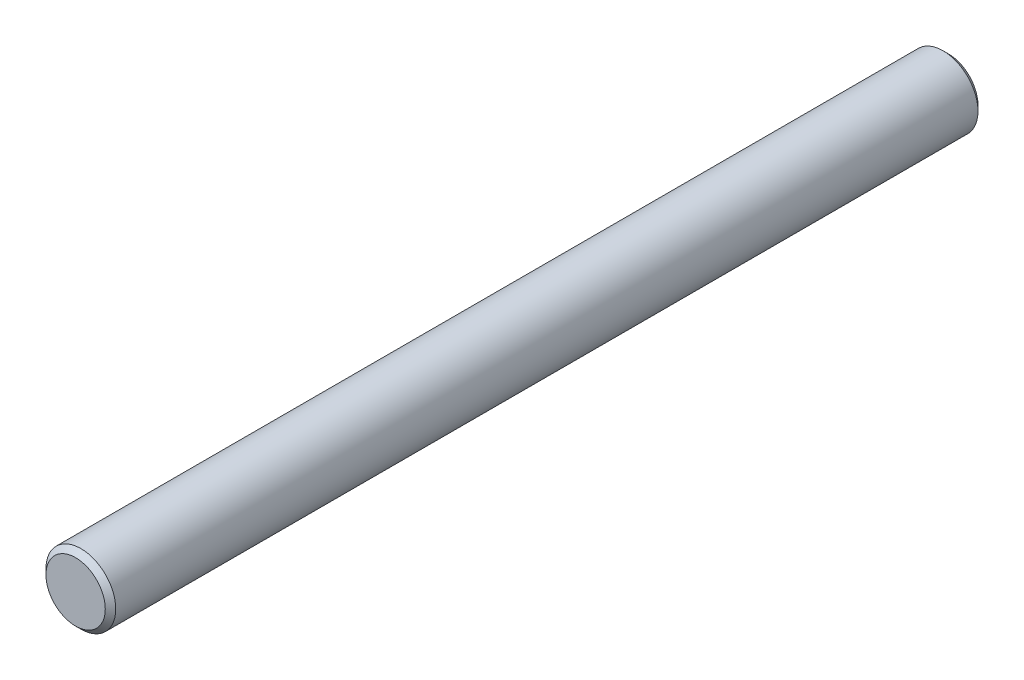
from build123d import *

# Parameters (mm, degrees)
ESQUISSE1_R        = 2
BOSS_EXTRU_1_DEPTH = 50
CHANFREIN1_SIZE    = 0.3


with BuildPart() as part:
    # Esquisse1 → Boss.-Extru.1 (new body)
    with BuildSketch(Plane.XY):
        Circle(ESQUISSE1_R)
    extrude(amount=BOSS_EXTRU_1_DEPTH)

    # Chanfrein1
    chanfrein1_edges = [part.edges().sort_by_distance(p)[0] for p in [
        (-2, 0, 0),
        (-2, 0, 50),
    ]]
    chamfer(chanfrein1_edges, length=CHANFREIN1_SIZE)


solid = part.part
